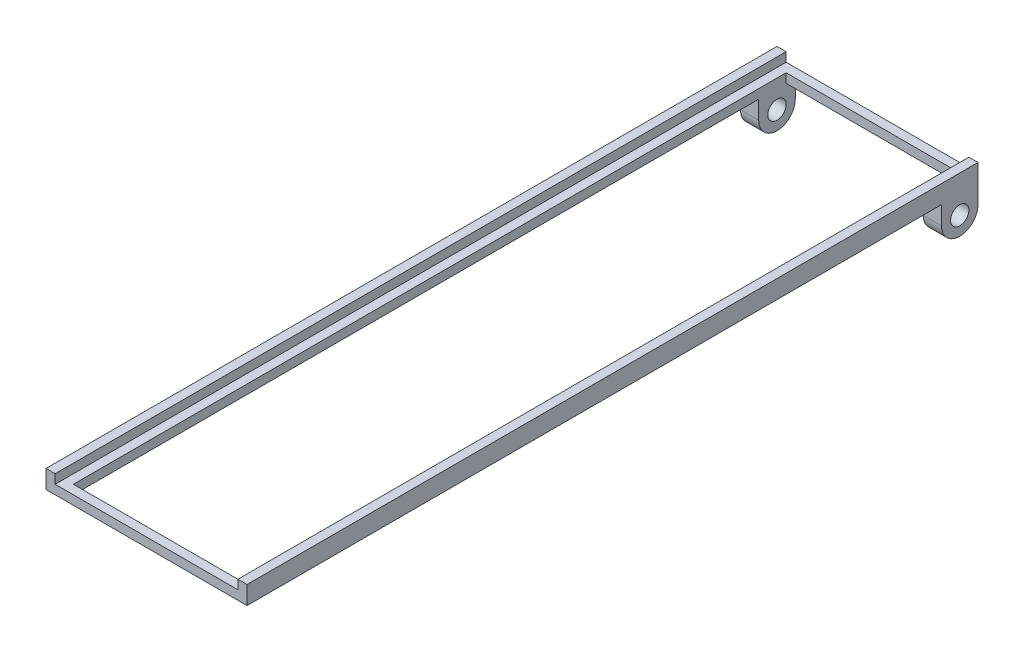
from build123d import *

# Parameters (mm, degrees)
BASE_EXTRUSION_DEPTH    = 800
ESQUISSE2_W             = 180
ESQUISSE2_H             = 780
ENL_V_MAT_EXTRU_1_DEPTH = 10
ESQUISSE3_R             = 10
BOSS_EXTRU_1_DEPTH      = 20


with BuildPart() as part:
    # Esquisse1 → Base-Extrusion (new body)
    with BuildSketch(Plane.XY):
        Polygon((100, 20), (110, 20), (110, 0), (50, 0), (-110, 0), (-110, 20), (-100, 20), (-100, 10), (50, 10), (100, 10), align=None)
    extrude(amount=BASE_EXTRUSION_DEPTH)

    # Esquisse2 → Enl_v. mat.-Extru.1 (cut)
    with BuildSketch(Plane(origin=(0, 10, 0), x_dir=(-1, 0, 0), z_dir=(0, 1, 0))):
        with Locations((0, 400)):
            Rectangle(ESQUISSE2_W, ESQUISSE2_H)
    extrude(amount=-ENL_V_MAT_EXTRU_1_DEPTH, mode=Mode.SUBTRACT)

    # Esquisse3 → Boss.-Extru.1 (add)
    with BuildSketch(Plane.ZY.offset(110)):
        with BuildLine():
            Line((0, 0), (0, -20))
            ThreePointArc((0, -20), (20, -40), (40, -20))
            Line((40, -20), (40, 0))
            Line((40, 0), (0, 0))
        make_face()
        with Locations(Location((20, -20, 0), (0, 0, 270))):
            Circle(ESQUISSE3_R, mode=Mode.SUBTRACT)
    boss_extru_1 = extrude(amount=-BOSS_EXTRU_1_DEPTH)

    # Sym_trie3: Boss.-Extru.1 across plane
    add(boss_extru_1.mirror(Plane(origin=(0, 0, 0), x_dir=(0, 0, 1), z_dir=(1, 0, 0))))


solid = part.part
